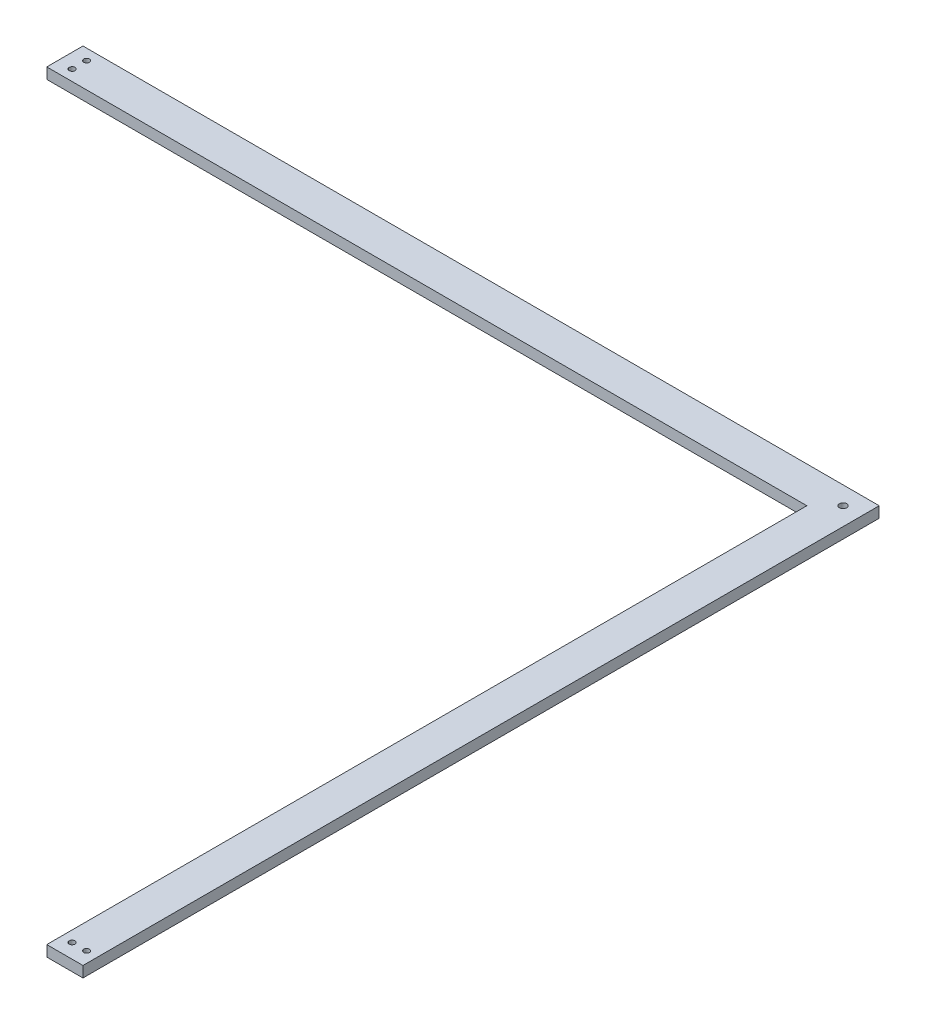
ISO-10303-21;
HEADER;
FILE_DESCRIPTION(('STEP AP214'),'2;1');
FILE_NAME('part.step','',(''),(''),'','','');
FILE_SCHEMA(('AUTOMOTIVE_DESIGN { 1 0 10303 214 1 1 1 1 }'));
ENDSEC;
DATA;
#1=APPLICATION_CONTEXT('core data for automotive mechanical design processes');
#2=APPLICATION_PROTOCOL_DEFINITION('international standard','automotive_design',2000,#1);
#3=PRODUCT_CONTEXT('',#1,'mechanical');
#4=PRODUCT('Part','Part','',(#3));
#5=PRODUCT_RELATED_PRODUCT_CATEGORY('part','',(#4));
#6=PRODUCT_DEFINITION_FORMATION('','',#4);
#7=PRODUCT_DEFINITION_CONTEXT('part definition',#1,'design');
#8=PRODUCT_DEFINITION('design','',#6,#7);
#9=PRODUCT_DEFINITION_SHAPE('','',#8);
#10=(LENGTH_UNIT() NAMED_UNIT(*) SI_UNIT(.MILLI.,.METRE.));
#11=(NAMED_UNIT(*) PLANE_ANGLE_UNIT() SI_UNIT($,.RADIAN.));
#12=(NAMED_UNIT(*) SI_UNIT($,.STERADIAN.) SOLID_ANGLE_UNIT());
#13=UNCERTAINTY_MEASURE_WITH_UNIT(LENGTH_MEASURE(1.E-05),#10,'distance_accuracy_value','');
#14=(GEOMETRIC_REPRESENTATION_CONTEXT(3) GLOBAL_UNCERTAINTY_ASSIGNED_CONTEXT((#13)) GLOBAL_UNIT_ASSIGNED_CONTEXT((#10,
#11,#12)) REPRESENTATION_CONTEXT('',''));
#15=CARTESIAN_POINT('',(0.,0.,0.));
#16=DIRECTION('',(0.,0.,1.));
#17=DIRECTION('',(1.,0.,0.));
#18=AXIS2_PLACEMENT_3D('',#15,#16,#17);
#19=CARTESIAN_POINT('',(0.,3.,0.));
#20=DIRECTION('',(0.,0.,-1.));
#21=DIRECTION('',(-1.,0.,0.));
#22=AXIS2_PLACEMENT_3D('',#19,#20,#21);
#23=PLANE('',#22);
#24=DIRECTION('',(1.,0.,0.));
#25=VECTOR('',#24,1.);
#26=CARTESIAN_POINT('',(0.,0.,0.));
#27=LINE('',#26,#25);
#28=CARTESIAN_POINT('',(210.,0.,0.));
#29=VERTEX_POINT('',#28);
#30=CARTESIAN_POINT('',(220.,0.,0.));
#31=VERTEX_POINT('',#30);
#32=EDGE_CURVE('E152',#29,#31,#27,.T.);
#33=ORIENTED_EDGE('',*,*,#32,.T.);
#34=DIRECTION('',(0.,-1.,0.));
#35=VECTOR('',#34,1.);
#36=CARTESIAN_POINT('',(220.,3.,0.));
#37=LINE('',#36,#35);
#38=CARTESIAN_POINT('',(220.,3.,0.));
#39=VERTEX_POINT('',#38);
#40=EDGE_CURVE('E11',#39,#31,#37,.T.);
#41=ORIENTED_EDGE('',*,*,#40,.F.);
#42=DIRECTION('',(1.,0.,0.));
#43=VECTOR('',#42,1.);
#44=CARTESIAN_POINT('',(0.,3.,0.));
#45=LINE('',#44,#43);
#46=CARTESIAN_POINT('',(210.,3.,0.));
#47=VERTEX_POINT('',#46);
#48=EDGE_CURVE('E345',#47,#39,#45,.T.);
#49=ORIENTED_EDGE('',*,*,#48,.F.);
#50=DIRECTION('',(0.,-1.,0.));
#51=VECTOR('',#50,1.);
#52=CARTESIAN_POINT('',(210.,3.,0.));
#53=LINE('',#52,#51);
#54=EDGE_CURVE('E59',#47,#29,#53,.T.);
#55=ORIENTED_EDGE('',*,*,#54,.T.);
#56=EDGE_LOOP('',(#33,#41,#49,#55));
#57=FACE_BOUND('',#56,.T.);
#58=ADVANCED_FACE('F41',(#57),#23,.F.);
#59=CARTESIAN_POINT('',(220.,3.,0.));
#60=DIRECTION('',(-1.,0.,0.));
#61=DIRECTION('',(0.,0.,1.));
#62=AXIS2_PLACEMENT_3D('',#59,#60,#61);
#63=PLANE('',#62);
#64=DIRECTION('',(0.,0.,-1.));
#65=VECTOR('',#64,1.);
#66=CARTESIAN_POINT('',(220.,0.,0.));
#67=LINE('',#66,#65);
#68=CARTESIAN_POINT('',(220.,0.,-220.));
#69=VERTEX_POINT('',#68);
#70=EDGE_CURVE('E155',#31,#69,#67,.T.);
#71=ORIENTED_EDGE('',*,*,#70,.T.);
#72=DIRECTION('',(0.,-1.,0.));
#73=VECTOR('',#72,1.);
#74=CARTESIAN_POINT('',(220.,3.,-220.));
#75=LINE('',#74,#73);
#76=CARTESIAN_POINT('',(220.,3.,-220.));
#77=VERTEX_POINT('',#76);
#78=EDGE_CURVE('E51',#77,#69,#75,.T.);
#79=ORIENTED_EDGE('',*,*,#78,.F.);
#80=DIRECTION('',(0.,0.,-1.));
#81=VECTOR('',#80,1.);
#82=CARTESIAN_POINT('',(220.,3.,0.));
#83=LINE('',#82,#81);
#84=EDGE_CURVE('E92',#39,#77,#83,.T.);
#85=ORIENTED_EDGE('',*,*,#84,.F.);
#86=ORIENTED_EDGE('',*,*,#40,.T.);
#87=EDGE_LOOP('',(#71,#79,#85,#86));
#88=FACE_BOUND('',#87,.T.);
#89=ADVANCED_FACE('F190',(#88),#63,.F.);
#90=CARTESIAN_POINT('',(0.,3.,-220.));
#91=DIRECTION('',(0.,0.,-1.));
#92=DIRECTION('',(-1.,0.,0.));
#93=AXIS2_PLACEMENT_3D('',#90,#91,#92);
#94=PLANE('',#93);
#95=DIRECTION('',(1.,0.,0.));
#96=VECTOR('',#95,1.);
#97=CARTESIAN_POINT('',(0.,0.,-220.));
#98=LINE('',#97,#96);
#99=CARTESIAN_POINT('',(0.,0.,-220.));
#100=VERTEX_POINT('',#99);
#101=EDGE_CURVE('E159',#100,#69,#98,.T.);
#102=ORIENTED_EDGE('',*,*,#101,.F.);
#103=DIRECTION('',(0.,-1.,0.));
#104=VECTOR('',#103,1.);
#105=CARTESIAN_POINT('',(0.,3.,-220.));
#106=LINE('',#105,#104);
#107=CARTESIAN_POINT('',(0.,3.,-220.));
#108=VERTEX_POINT('',#107);
#109=EDGE_CURVE('E122',#108,#100,#106,.T.);
#110=ORIENTED_EDGE('',*,*,#109,.F.);
#111=DIRECTION('',(1.,0.,0.));
#112=VECTOR('',#111,1.);
#113=CARTESIAN_POINT('',(0.,3.,-220.));
#114=LINE('',#113,#112);
#115=EDGE_CURVE('E110',#108,#77,#114,.T.);
#116=ORIENTED_EDGE('',*,*,#115,.T.);
#117=ORIENTED_EDGE('',*,*,#78,.T.);
#118=EDGE_LOOP('',(#102,#110,#116,#117));
#119=FACE_BOUND('',#118,.T.);
#120=ADVANCED_FACE('F189',(#119),#94,.T.);
#121=CARTESIAN_POINT('',(0.,3.,0.));
#122=DIRECTION('',(1.,0.,0.));
#123=DIRECTION('',(0.,0.,-1.));
#124=AXIS2_PLACEMENT_3D('',#121,#122,#123);
#125=PLANE('',#124);
#126=DIRECTION('',(0.,0.,1.));
#127=VECTOR('',#126,1.);
#128=CARTESIAN_POINT('',(0.,0.,0.));
#129=LINE('',#128,#127);
#130=CARTESIAN_POINT('',(0.,0.,-210.));
#131=VERTEX_POINT('',#130);
#132=EDGE_CURVE('E118',#100,#131,#129,.T.);
#133=ORIENTED_EDGE('',*,*,#132,.T.);
#134=DIRECTION('',(0.,-1.,0.));
#135=VECTOR('',#134,1.);
#136=CARTESIAN_POINT('',(0.,3.,-210.));
#137=LINE('',#136,#135);
#138=CARTESIAN_POINT('',(0.,3.,-210.));
#139=VERTEX_POINT('',#138);
#140=EDGE_CURVE('E115',#139,#131,#137,.T.);
#141=ORIENTED_EDGE('',*,*,#140,.F.);
#142=DIRECTION('',(0.,0.,1.));
#143=VECTOR('',#142,1.);
#144=CARTESIAN_POINT('',(0.,3.,0.));
#145=LINE('',#144,#143);
#146=EDGE_CURVE('E102',#108,#139,#145,.T.);
#147=ORIENTED_EDGE('',*,*,#146,.F.);
#148=ORIENTED_EDGE('',*,*,#109,.T.);
#149=EDGE_LOOP('',(#133,#141,#147,#148));
#150=FACE_BOUND('',#149,.T.);
#151=ADVANCED_FACE('F116',(#150),#125,.F.);
#152=CARTESIAN_POINT('',(0.,3.,-210.));
#153=DIRECTION('',(0.,0.,-1.));
#154=DIRECTION('',(-1.,0.,0.));
#155=AXIS2_PLACEMENT_3D('',#152,#153,#154);
#156=PLANE('',#155);
#157=DIRECTION('',(1.,0.,0.));
#158=VECTOR('',#157,1.);
#159=CARTESIAN_POINT('',(0.,0.,-210.));
#160=LINE('',#159,#158);
#161=CARTESIAN_POINT('',(210.,0.,-210.));
#162=VERTEX_POINT('',#161);
#163=EDGE_CURVE('E165',#131,#162,#160,.T.);
#164=ORIENTED_EDGE('',*,*,#163,.T.);
#165=DIRECTION('',(0.,-1.,0.));
#166=VECTOR('',#165,1.);
#167=CARTESIAN_POINT('',(210.,3.,-210.));
#168=LINE('',#167,#166);
#169=CARTESIAN_POINT('',(210.,3.,-210.));
#170=VERTEX_POINT('',#169);
#171=EDGE_CURVE('E80',#170,#162,#168,.T.);
#172=ORIENTED_EDGE('',*,*,#171,.F.);
#173=DIRECTION('',(1.,0.,0.));
#174=VECTOR('',#173,1.);
#175=CARTESIAN_POINT('',(0.,3.,-210.));
#176=LINE('',#175,#174);
#177=EDGE_CURVE('E108',#139,#170,#176,.T.);
#178=ORIENTED_EDGE('',*,*,#177,.F.);
#179=ORIENTED_EDGE('',*,*,#140,.T.);
#180=EDGE_LOOP('',(#164,#172,#178,#179));
#181=FACE_BOUND('',#180,.T.);
#182=ADVANCED_FACE('F124',(#181),#156,.F.);
#183=CARTESIAN_POINT('',(4.00000000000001,3.,-217.));
#184=DIRECTION('',(0.,-1.,0.));
#185=DIRECTION('',(0.,0.,-1.));
#186=AXIS2_PLACEMENT_3D('',#183,#184,#185);
#187=CYLINDRICAL_SURFACE('',#186,0.799999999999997);
#188=CARTESIAN_POINT('',(4.00000000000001,3.,-217.));
#189=DIRECTION('',(0.,1.,0.));
#190=DIRECTION('',(0.,0.,1.));
#191=AXIS2_PLACEMENT_3D('',#188,#189,#190);
#192=CIRCLE('',#191,0.799999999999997);
#193=CARTESIAN_POINT('',(4.00000000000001,3.,-216.2));
#194=VERTEX_POINT('',#193);
#195=EDGE_CURVE('E129',#194,#194,#192,.T.);
#196=ORIENTED_EDGE('',*,*,#195,.T.);
#197=EDGE_LOOP('',(#196));
#198=FACE_BOUND('',#197,.T.);
#199=CARTESIAN_POINT('',(4.00000000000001,0.,-217.));
#200=DIRECTION('',(0.,1.,0.));
#201=DIRECTION('',(0.,0.,1.));
#202=AXIS2_PLACEMENT_3D('',#199,#200,#201);
#203=CIRCLE('',#202,0.799999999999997);
#204=CARTESIAN_POINT('',(4.00000000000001,0.,-216.2));
#205=VERTEX_POINT('',#204);
#206=EDGE_CURVE('E172',#205,#205,#203,.T.);
#207=ORIENTED_EDGE('',*,*,#206,.F.);
#208=EDGE_LOOP('',(#207));
#209=FACE_BOUND('',#208,.T.);
#210=ADVANCED_FACE('F198',(#198,#209),#187,.F.);
#211=CARTESIAN_POINT('',(210.,3.,0.));
#212=DIRECTION('',(-1.,0.,0.));
#213=DIRECTION('',(0.,0.,1.));
#214=AXIS2_PLACEMENT_3D('',#211,#212,#213);
#215=PLANE('',#214);
#216=DIRECTION('',(0.,0.,-1.));
#217=VECTOR('',#216,1.);
#218=CARTESIAN_POINT('',(210.,0.,0.));
#219=LINE('',#218,#217);
#220=EDGE_CURVE('E168',#29,#162,#219,.T.);
#221=ORIENTED_EDGE('',*,*,#220,.F.);
#222=ORIENTED_EDGE('',*,*,#54,.F.);
#223=DIRECTION('',(0.,0.,-1.));
#224=VECTOR('',#223,1.);
#225=CARTESIAN_POINT('',(210.,3.,0.));
#226=LINE('',#225,#224);
#227=EDGE_CURVE('E126',#47,#170,#226,.T.);
#228=ORIENTED_EDGE('',*,*,#227,.T.);
#229=ORIENTED_EDGE('',*,*,#171,.T.);
#230=EDGE_LOOP('',(#221,#222,#228,#229));
#231=FACE_BOUND('',#230,.T.);
#232=ADVANCED_FACE('F195',(#231),#215,.T.);
#233=CARTESIAN_POINT('',(215.,3.,-215.));
#234=DIRECTION('',(0.,-1.,0.));
#235=DIRECTION('',(0.,0.,-1.));
#236=AXIS2_PLACEMENT_3D('',#233,#234,#235);
#237=CYLINDRICAL_SURFACE('',#236,0.999999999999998);
#238=CARTESIAN_POINT('',(215.,3.,-215.));
#239=DIRECTION('',(0.,1.,0.));
#240=DIRECTION('',(0.,0.,1.));
#241=AXIS2_PLACEMENT_3D('',#238,#239,#240);
#242=CIRCLE('',#241,0.999999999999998);
#243=CARTESIAN_POINT('',(215.,3.,-214.));
#244=VERTEX_POINT('',#243);
#245=EDGE_CURVE('E343',#244,#244,#242,.T.);
#246=ORIENTED_EDGE('',*,*,#245,.T.);
#247=EDGE_LOOP('',(#246));
#248=FACE_BOUND('',#247,.T.);
#249=CARTESIAN_POINT('',(215.,0.,-215.));
#250=DIRECTION('',(0.,1.,0.));
#251=DIRECTION('',(0.,0.,1.));
#252=AXIS2_PLACEMENT_3D('',#249,#250,#251);
#253=CIRCLE('',#252,0.999999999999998);
#254=CARTESIAN_POINT('',(215.,0.,-214.));
#255=VERTEX_POINT('',#254);
#256=EDGE_CURVE('E148',#255,#255,#253,.T.);
#257=ORIENTED_EDGE('',*,*,#256,.F.);
#258=EDGE_LOOP('',(#257));
#259=FACE_BOUND('',#258,.T.);
#260=ADVANCED_FACE('F197',(#248,#259),#237,.F.);
#261=CARTESIAN_POINT('',(217.,3.,-4.));
#262=DIRECTION('',(0.,-1.,0.));
#263=DIRECTION('',(0.,0.,-1.));
#264=AXIS2_PLACEMENT_3D('',#261,#262,#263);
#265=CYLINDRICAL_SURFACE('',#264,0.799999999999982);
#266=CARTESIAN_POINT('',(217.,3.,-4.));
#267=DIRECTION('',(0.,1.,0.));
#268=DIRECTION('',(0.,0.,1.));
#269=AXIS2_PLACEMENT_3D('',#266,#267,#268);
#270=CIRCLE('',#269,0.799999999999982);
#271=CARTESIAN_POINT('',(217.,3.,-3.20000000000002));
#272=VERTEX_POINT('',#271);
#273=EDGE_CURVE('E227',#272,#272,#270,.T.);
#274=ORIENTED_EDGE('',*,*,#273,.T.);
#275=EDGE_LOOP('',(#274));
#276=FACE_BOUND('',#275,.T.);
#277=CARTESIAN_POINT('',(217.,0.,-4.));
#278=DIRECTION('',(0.,1.,0.));
#279=DIRECTION('',(0.,0.,1.));
#280=AXIS2_PLACEMENT_3D('',#277,#278,#279);
#281=CIRCLE('',#280,0.799999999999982);
#282=CARTESIAN_POINT('',(217.,0.,-3.20000000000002));
#283=VERTEX_POINT('',#282);
#284=EDGE_CURVE('E144',#283,#283,#281,.T.);
#285=ORIENTED_EDGE('',*,*,#284,.F.);
#286=EDGE_LOOP('',(#285));
#287=FACE_BOUND('',#286,.T.);
#288=ADVANCED_FACE('F204',(#276,#287),#265,.F.);
#289=CARTESIAN_POINT('',(213.,3.,-4.));
#290=DIRECTION('',(0.,-1.,0.));
#291=DIRECTION('',(0.,0.,-1.));
#292=AXIS2_PLACEMENT_3D('',#289,#290,#291);
#293=CYLINDRICAL_SURFACE('',#292,0.799999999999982);
#294=CARTESIAN_POINT('',(213.,3.,-4.));
#295=DIRECTION('',(0.,1.,0.));
#296=DIRECTION('',(0.,0.,1.));
#297=AXIS2_PLACEMENT_3D('',#294,#295,#296);
#298=CIRCLE('',#297,0.799999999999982);
#299=CARTESIAN_POINT('',(213.,3.,-3.20000000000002));
#300=VERTEX_POINT('',#299);
#301=EDGE_CURVE('E180',#300,#300,#298,.F.);
#302=ORIENTED_EDGE('',*,*,#301,.F.);
#303=EDGE_LOOP('',(#302));
#304=FACE_BOUND('',#303,.T.);
#305=CARTESIAN_POINT('',(213.,0.,-4.));
#306=DIRECTION('',(0.,1.,0.));
#307=DIRECTION('',(0.,0.,1.));
#308=AXIS2_PLACEMENT_3D('',#305,#306,#307);
#309=CIRCLE('',#308,0.799999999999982);
#310=CARTESIAN_POINT('',(213.,0.,-3.20000000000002));
#311=VERTEX_POINT('',#310);
#312=EDGE_CURVE('E140',#311,#311,#309,.F.);
#313=ORIENTED_EDGE('',*,*,#312,.T.);
#314=EDGE_LOOP('',(#313));
#315=FACE_BOUND('',#314,.T.);
#316=ADVANCED_FACE('F43',(#304,#315),#293,.F.);
#317=CARTESIAN_POINT('',(4.00000000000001,3.,-213.));
#318=DIRECTION('',(0.,-1.,0.));
#319=DIRECTION('',(0.,0.,-1.));
#320=AXIS2_PLACEMENT_3D('',#317,#318,#319);
#321=CYLINDRICAL_SURFACE('',#320,0.799999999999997);
#322=CARTESIAN_POINT('',(4.00000000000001,3.,-213.));
#323=DIRECTION('',(0.,1.,0.));
#324=DIRECTION('',(0.,0.,1.));
#325=AXIS2_PLACEMENT_3D('',#322,#323,#324);
#326=CIRCLE('',#325,0.799999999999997);
#327=CARTESIAN_POINT('',(4.00000000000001,3.,-212.2));
#328=VERTEX_POINT('',#327);
#329=EDGE_CURVE('E136',#328,#328,#326,.F.);
#330=ORIENTED_EDGE('',*,*,#329,.F.);
#331=EDGE_LOOP('',(#330));
#332=FACE_BOUND('',#331,.T.);
#333=CARTESIAN_POINT('',(4.00000000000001,0.,-213.));
#334=DIRECTION('',(0.,1.,0.));
#335=DIRECTION('',(0.,0.,1.));
#336=AXIS2_PLACEMENT_3D('',#333,#334,#335);
#337=CIRCLE('',#336,0.799999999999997);
#338=CARTESIAN_POINT('',(4.00000000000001,0.,-212.2));
#339=VERTEX_POINT('',#338);
#340=EDGE_CURVE('E176',#339,#339,#337,.F.);
#341=ORIENTED_EDGE('',*,*,#340,.T.);
#342=EDGE_LOOP('',(#341));
#343=FACE_BOUND('',#342,.T.);
#344=ADVANCED_FACE('F222',(#332,#343),#321,.F.);
#345=CARTESIAN_POINT('',(0.,3.,0.));
#346=DIRECTION('',(0.,1.,0.));
#347=DIRECTION('',(0.,0.,1.));
#348=AXIS2_PLACEMENT_3D('',#345,#346,#347);
#349=PLANE('',#348);
#350=ORIENTED_EDGE('',*,*,#301,.T.);
#351=EDGE_LOOP('',(#350));
#352=FACE_BOUND('',#351,.T.);
#353=ORIENTED_EDGE('',*,*,#273,.F.);
#354=EDGE_LOOP('',(#353));
#355=FACE_BOUND('',#354,.T.);
#356=ORIENTED_EDGE('',*,*,#245,.F.);
#357=EDGE_LOOP('',(#356));
#358=FACE_BOUND('',#357,.T.);
#359=ORIENTED_EDGE('',*,*,#48,.T.);
#360=ORIENTED_EDGE('',*,*,#84,.T.);
#361=ORIENTED_EDGE('',*,*,#115,.F.);
#362=ORIENTED_EDGE('',*,*,#146,.T.);
#363=ORIENTED_EDGE('',*,*,#177,.T.);
#364=ORIENTED_EDGE('',*,*,#227,.F.);
#365=EDGE_LOOP('',(#359,#360,#361,#362,#363,#364));
#366=FACE_BOUND('',#365,.T.);
#367=ORIENTED_EDGE('',*,*,#195,.F.);
#368=EDGE_LOOP('',(#367));
#369=FACE_BOUND('',#368,.T.);
#370=ORIENTED_EDGE('',*,*,#329,.T.);
#371=EDGE_LOOP('',(#370));
#372=FACE_BOUND('',#371,.T.);
#373=ADVANCED_FACE('F104',(#352,#355,#358,#366,#369,#372),#349,.T.);
#374=CARTESIAN_POINT('',(0.,0.,0.));
#375=DIRECTION('',(0.,1.,0.));
#376=DIRECTION('',(0.,0.,1.));
#377=AXIS2_PLACEMENT_3D('',#374,#375,#376);
#378=PLANE('',#377);
#379=ORIENTED_EDGE('',*,*,#312,.F.);
#380=EDGE_LOOP('',(#379));
#381=FACE_BOUND('',#380,.T.);
#382=ORIENTED_EDGE('',*,*,#284,.T.);
#383=EDGE_LOOP('',(#382));
#384=FACE_BOUND('',#383,.T.);
#385=ORIENTED_EDGE('',*,*,#256,.T.);
#386=EDGE_LOOP('',(#385));
#387=FACE_BOUND('',#386,.T.);
#388=ORIENTED_EDGE('',*,*,#32,.F.);
#389=ORIENTED_EDGE('',*,*,#220,.T.);
#390=ORIENTED_EDGE('',*,*,#163,.F.);
#391=ORIENTED_EDGE('',*,*,#132,.F.);
#392=ORIENTED_EDGE('',*,*,#101,.T.);
#393=ORIENTED_EDGE('',*,*,#70,.F.);
#394=EDGE_LOOP('',(#388,#389,#390,#391,#392,#393));
#395=FACE_BOUND('',#394,.T.);
#396=ORIENTED_EDGE('',*,*,#206,.T.);
#397=EDGE_LOOP('',(#396));
#398=FACE_BOUND('',#397,.T.);
#399=ORIENTED_EDGE('',*,*,#340,.F.);
#400=EDGE_LOOP('',(#399));
#401=FACE_BOUND('',#400,.T.);
#402=ADVANCED_FACE('F193',(#381,#384,#387,#395,#398,#401),#378,.F.);
#403=CLOSED_SHELL('',(#58,#89,#120,#151,#182,#210,#232,#260,#288,#316,#344,#373,#402));
#404=MANIFOLD_SOLID_BREP('B2',#403);
#405=ADVANCED_BREP_SHAPE_REPRESENTATION('',(#18,#404),#14);
#406=SHAPE_DEFINITION_REPRESENTATION(#9,#405);
ENDSEC;
END-ISO-10303-21;
